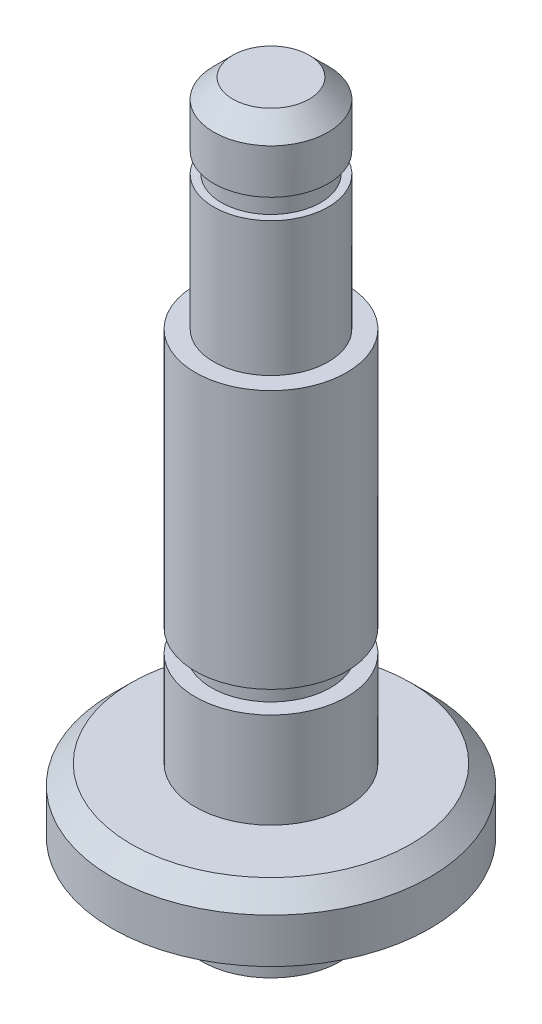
ISO-10303-21;
HEADER;
FILE_DESCRIPTION(('STEP AP214'),'2;1');
FILE_NAME('part.step','',(''),(''),'','','');
FILE_SCHEMA(('AUTOMOTIVE_DESIGN { 1 0 10303 214 1 1 1 1 }'));
ENDSEC;
DATA;
#1=APPLICATION_CONTEXT('core data for automotive mechanical design processes');
#2=APPLICATION_PROTOCOL_DEFINITION('international standard','automotive_design',2000,#1);
#3=PRODUCT_CONTEXT('',#1,'mechanical');
#4=PRODUCT('Part','Part','',(#3));
#5=PRODUCT_RELATED_PRODUCT_CATEGORY('part','',(#4));
#6=PRODUCT_DEFINITION_FORMATION('','',#4);
#7=PRODUCT_DEFINITION_CONTEXT('part definition',#1,'design');
#8=PRODUCT_DEFINITION('design','',#6,#7);
#9=PRODUCT_DEFINITION_SHAPE('','',#8);
#10=(LENGTH_UNIT() NAMED_UNIT(*) SI_UNIT(.MILLI.,.METRE.));
#11=(NAMED_UNIT(*) PLANE_ANGLE_UNIT() SI_UNIT($,.RADIAN.));
#12=(NAMED_UNIT(*) SI_UNIT($,.STERADIAN.) SOLID_ANGLE_UNIT());
#13=UNCERTAINTY_MEASURE_WITH_UNIT(LENGTH_MEASURE(1.E-05),#10,'distance_accuracy_value','');
#14=(GEOMETRIC_REPRESENTATION_CONTEXT(3) GLOBAL_UNCERTAINTY_ASSIGNED_CONTEXT((#13)) GLOBAL_UNIT_ASSIGNED_CONTEXT((#10,
#11,#12)) REPRESENTATION_CONTEXT('',''));
#15=CARTESIAN_POINT('',(0.,0.,0.));
#16=DIRECTION('',(0.,0.,1.));
#17=DIRECTION('',(1.,0.,0.));
#18=AXIS2_PLACEMENT_3D('',#15,#16,#17);
#19=CARTESIAN_POINT('',(0.,0.,0.));
#20=DIRECTION('',(0.,-1.,0.));
#21=DIRECTION('',(0.,0.,-1.));
#22=AXIS2_PLACEMENT_3D('',#19,#20,#21);
#23=CYLINDRICAL_SURFACE('',#22,2.286);
#24=CARTESIAN_POINT('',(0.,22.9362,0.));
#25=DIRECTION('',(0.,-1.,0.));
#26=DIRECTION('',(0.,0.,-1.));
#27=AXIS2_PLACEMENT_3D('',#24,#25,#26);
#28=CIRCLE('',#27,2.286);
#29=CARTESIAN_POINT('',(0.,22.9362,-2.286));
#30=VERTEX_POINT('',#29);
#31=EDGE_CURVE('E81',#30,#30,#28,.T.);
#32=ORIENTED_EDGE('',*,*,#31,.T.);
#33=EDGE_LOOP('',(#32));
#34=FACE_BOUND('',#33,.T.);
#35=CARTESIAN_POINT('',(0.,17.5768,0.));
#36=DIRECTION('',(0.,-1.,0.));
#37=DIRECTION('',(0.,0.,-1.));
#38=AXIS2_PLACEMENT_3D('',#35,#36,#37);
#39=CIRCLE('',#38,2.286);
#40=CARTESIAN_POINT('',(0.,17.5768,-2.286));
#41=VERTEX_POINT('',#40);
#42=EDGE_CURVE('E63',#41,#41,#39,.T.);
#43=ORIENTED_EDGE('',*,*,#42,.F.);
#44=EDGE_LOOP('',(#43));
#45=FACE_BOUND('',#44,.T.);
#46=ADVANCED_FACE('F31',(#34,#45),#23,.T.);
#47=CARTESIAN_POINT('',(0.,0.,0.));
#48=DIRECTION('',(0.,-1.,0.));
#49=DIRECTION('',(0.,0.,-1.));
#50=AXIS2_PLACEMENT_3D('',#47,#48,#49);
#51=CYLINDRICAL_SURFACE('',#50,3.0226);
#52=CARTESIAN_POINT('',(0.,6.35,0.));
#53=DIRECTION('',(0.,-1.,0.));
#54=DIRECTION('',(0.,0.,-1.));
#55=AXIS2_PLACEMENT_3D('',#52,#53,#54);
#56=CIRCLE('',#55,3.0226);
#57=CARTESIAN_POINT('',(0.,6.35,-3.0226));
#58=VERTEX_POINT('',#57);
#59=EDGE_CURVE('E69',#58,#58,#56,.T.);
#60=ORIENTED_EDGE('',*,*,#59,.T.);
#61=EDGE_LOOP('',(#60));
#62=FACE_BOUND('',#61,.T.);
#63=CARTESIAN_POINT('',(0.,2.54,0.));
#64=DIRECTION('',(0.,-1.,0.));
#65=DIRECTION('',(0.,0.,-1.));
#66=AXIS2_PLACEMENT_3D('',#63,#64,#65);
#67=CIRCLE('',#66,3.0226);
#68=CARTESIAN_POINT('',(0.,2.54,-3.0226));
#69=VERTEX_POINT('',#68);
#70=EDGE_CURVE('E57',#69,#69,#67,.T.);
#71=ORIENTED_EDGE('',*,*,#70,.F.);
#72=EDGE_LOOP('',(#71));
#73=FACE_BOUND('',#72,.T.);
#74=ADVANCED_FACE('F107',(#62,#73),#51,.T.);
#75=CARTESIAN_POINT('',(0.,0.,0.));
#76=DIRECTION('',(0.,-1.,0.));
#77=DIRECTION('',(0.,0.,-1.));
#78=AXIS2_PLACEMENT_3D('',#75,#76,#77);
#79=CYLINDRICAL_SURFACE('',#78,2.778125);
#80=CARTESIAN_POINT('',(0.,0.,0.));
#81=DIRECTION('',(0.,-1.,0.));
#82=DIRECTION('',(0.,0.,-1.));
#83=AXIS2_PLACEMENT_3D('',#80,#81,#82);
#84=CIRCLE('',#83,2.778125);
#85=CARTESIAN_POINT('',(0.,0.,-2.778125));
#86=VERTEX_POINT('',#85);
#87=EDGE_CURVE('E51',#86,#86,#84,.T.);
#88=ORIENTED_EDGE('',*,*,#87,.T.);
#89=EDGE_LOOP('',(#88));
#90=FACE_BOUND('',#89,.T.);
#91=CARTESIAN_POINT('',(0.,-2.921,0.));
#92=DIRECTION('',(0.,-1.,0.));
#93=DIRECTION('',(0.,0.,-1.));
#94=AXIS2_PLACEMENT_3D('',#91,#92,#93);
#95=CIRCLE('',#94,2.778125);
#96=CARTESIAN_POINT('',(0.,-2.921,-2.778125));
#97=VERTEX_POINT('',#96);
#98=EDGE_CURVE('E66',#97,#97,#95,.T.);
#99=ORIENTED_EDGE('',*,*,#98,.F.);
#100=EDGE_LOOP('',(#99));
#101=FACE_BOUND('',#100,.T.);
#102=ADVANCED_FACE('F112',(#90,#101),#79,.T.);
#103=CARTESIAN_POINT('',(0.,0.,-2.778125));
#104=DIRECTION('',(0.,-1.,0.));
#105=DIRECTION('',(0.,0.,-1.));
#106=AXIS2_PLACEMENT_3D('',#103,#104,#105);
#107=PLANE('',#106);
#108=CARTESIAN_POINT('',(0.,0.,0.));
#109=DIRECTION('',(0.,-1.,0.));
#110=DIRECTION('',(0.,0.,-1.));
#111=AXIS2_PLACEMENT_3D('',#108,#109,#110);
#112=CIRCLE('',#111,6.35);
#113=CARTESIAN_POINT('',(0.,0.,-6.35));
#114=VERTEX_POINT('',#113);
#115=EDGE_CURVE('E54',#114,#114,#112,.T.);
#116=ORIENTED_EDGE('',*,*,#115,.T.);
#117=EDGE_LOOP('',(#116));
#118=FACE_BOUND('',#117,.T.);
#119=ORIENTED_EDGE('',*,*,#87,.F.);
#120=EDGE_LOOP('',(#119));
#121=FACE_BOUND('',#120,.T.);
#122=ADVANCED_FACE('F145',(#118,#121),#107,.T.);
#123=CARTESIAN_POINT('',(0.,0.,0.));
#124=DIRECTION('',(0.,-1.,0.));
#125=DIRECTION('',(0.,0.,-1.));
#126=AXIS2_PLACEMENT_3D('',#123,#124,#125);
#127=CYLINDRICAL_SURFACE('',#126,6.35);
#128=CARTESIAN_POINT('',(0.,1.778,0.));
#129=DIRECTION('',(0.,1.,0.));
#130=DIRECTION('',(0.,0.,1.));
#131=AXIS2_PLACEMENT_3D('',#128,#129,#130);
#132=CIRCLE('',#131,6.35);
#133=CARTESIAN_POINT('',(0.,1.778,6.35));
#134=VERTEX_POINT('',#133);
#135=EDGE_CURVE('E46',#134,#134,#132,.F.);
#136=ORIENTED_EDGE('',*,*,#135,.T.);
#137=EDGE_LOOP('',(#136));
#138=FACE_BOUND('',#137,.T.);
#139=ORIENTED_EDGE('',*,*,#115,.F.);
#140=EDGE_LOOP('',(#139));
#141=FACE_BOUND('',#140,.T.);
#142=ADVANCED_FACE('F141',(#138,#141),#127,.T.);
#143=CARTESIAN_POINT('',(0.,2.54,-6.35));
#144=DIRECTION('',(0.,1.,0.));
#145=DIRECTION('',(0.,0.,1.));
#146=AXIS2_PLACEMENT_3D('',#143,#144,#145);
#147=PLANE('',#146);
#148=CARTESIAN_POINT('',(0.,2.54,0.));
#149=DIRECTION('',(0.,1.,0.));
#150=DIRECTION('',(0.,0.,1.));
#151=AXIS2_PLACEMENT_3D('',#148,#149,#150);
#152=CIRCLE('',#151,5.588);
#153=CARTESIAN_POINT('',(0.,2.54,5.588));
#154=VERTEX_POINT('',#153);
#155=EDGE_CURVE('E42',#154,#154,#152,.T.);
#156=ORIENTED_EDGE('',*,*,#155,.T.);
#157=EDGE_LOOP('',(#156));
#158=FACE_BOUND('',#157,.T.);
#159=ORIENTED_EDGE('',*,*,#70,.T.);
#160=EDGE_LOOP('',(#159));
#161=FACE_BOUND('',#160,.T.);
#162=ADVANCED_FACE('F137',(#158,#161),#147,.T.);
#163=CARTESIAN_POINT('',(0.,-2.921,0.));
#164=DIRECTION('',(0.,-1.,0.));
#165=DIRECTION('',(0.,0.,-1.));
#166=AXIS2_PLACEMENT_3D('',#163,#164,#165);
#167=PLANE('',#166);
#168=ORIENTED_EDGE('',*,*,#98,.T.);
#169=EDGE_LOOP('',(#168));
#170=FACE_BOUND('',#169,.T.);
#171=ADVANCED_FACE('F140',(#170),#167,.T.);
#172=CARTESIAN_POINT('',(0.,1.778,0.));
#173=DIRECTION('',(0.,-1.,0.));
#174=DIRECTION('',(0.,0.,-1.));
#175=AXIS2_PLACEMENT_3D('',#172,#173,#174);
#176=CONICAL_SURFACE('',#175,6.35,0.78539816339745);
#177=ORIENTED_EDGE('',*,*,#155,.F.);
#178=EDGE_LOOP('',(#177));
#179=FACE_BOUND('',#178,.T.);
#180=ORIENTED_EDGE('',*,*,#135,.F.);
#181=EDGE_LOOP('',(#180));
#182=FACE_BOUND('',#181,.T.);
#183=ADVANCED_FACE('F152',(#179,#182),#176,.T.);
#184=CARTESIAN_POINT('',(0.,6.35,-3.0226));
#185=DIRECTION('',(0.,-1.,0.));
#186=DIRECTION('',(0.,0.,-1.));
#187=AXIS2_PLACEMENT_3D('',#184,#185,#186);
#188=PLANE('',#187);
#189=ORIENTED_EDGE('',*,*,#59,.F.);
#190=EDGE_LOOP('',(#189));
#191=FACE_BOUND('',#190,.T.);
#192=CARTESIAN_POINT('',(0.,6.35,0.));
#193=DIRECTION('',(0.,-1.,0.));
#194=DIRECTION('',(0.,0.,-1.));
#195=AXIS2_PLACEMENT_3D('',#192,#193,#194);
#196=CIRCLE('',#195,2.38125);
#197=CARTESIAN_POINT('',(0.,6.35,-2.38125));
#198=VERTEX_POINT('',#197);
#199=EDGE_CURVE('E72',#198,#198,#196,.T.);
#200=ORIENTED_EDGE('',*,*,#199,.T.);
#201=EDGE_LOOP('',(#200));
#202=FACE_BOUND('',#201,.T.);
#203=ADVANCED_FACE('F154',(#191,#202),#188,.F.);
#204=CARTESIAN_POINT('',(0.,0.,0.));
#205=DIRECTION('',(0.,-1.,0.));
#206=DIRECTION('',(0.,0.,-1.));
#207=AXIS2_PLACEMENT_3D('',#204,#205,#206);
#208=CYLINDRICAL_SURFACE('',#207,2.38125);
#209=ORIENTED_EDGE('',*,*,#199,.F.);
#210=EDGE_LOOP('',(#209));
#211=FACE_BOUND('',#210,.T.);
#212=CARTESIAN_POINT('',(0.,7.239,0.));
#213=DIRECTION('',(0.,-1.,0.));
#214=DIRECTION('',(0.,0.,-1.));
#215=AXIS2_PLACEMENT_3D('',#212,#213,#214);
#216=CIRCLE('',#215,2.38125);
#217=CARTESIAN_POINT('',(0.,7.239,-2.38125));
#218=VERTEX_POINT('',#217);
#219=EDGE_CURVE('E75',#218,#218,#216,.T.);
#220=ORIENTED_EDGE('',*,*,#219,.T.);
#221=EDGE_LOOP('',(#220));
#222=FACE_BOUND('',#221,.T.);
#223=ADVANCED_FACE('F160',(#211,#222),#208,.T.);
#224=CARTESIAN_POINT('',(0.,7.239,-3.0226));
#225=DIRECTION('',(0.,1.,0.));
#226=DIRECTION('',(0.,0.,1.));
#227=AXIS2_PLACEMENT_3D('',#224,#225,#226);
#228=PLANE('',#227);
#229=ORIENTED_EDGE('',*,*,#219,.F.);
#230=EDGE_LOOP('',(#229));
#231=FACE_BOUND('',#230,.T.);
#232=CARTESIAN_POINT('',(0.,7.239,0.));
#233=DIRECTION('',(0.,-1.,0.));
#234=DIRECTION('',(0.,0.,-1.));
#235=AXIS2_PLACEMENT_3D('',#232,#233,#234);
#236=CIRCLE('',#235,3.0226);
#237=CARTESIAN_POINT('',(0.,7.239,-3.0226));
#238=VERTEX_POINT('',#237);
#239=EDGE_CURVE('E78',#238,#238,#236,.T.);
#240=ORIENTED_EDGE('',*,*,#239,.T.);
#241=EDGE_LOOP('',(#240));
#242=FACE_BOUND('',#241,.T.);
#243=ADVANCED_FACE('F123',(#231,#242),#228,.F.);
#244=CARTESIAN_POINT('',(0.,17.5768,-3.0226));
#245=DIRECTION('',(0.,1.,0.));
#246=DIRECTION('',(0.,0.,1.));
#247=AXIS2_PLACEMENT_3D('',#244,#245,#246);
#248=PLANE('',#247);
#249=ORIENTED_EDGE('',*,*,#42,.T.);
#250=EDGE_LOOP('',(#249));
#251=FACE_BOUND('',#250,.T.);
#252=CARTESIAN_POINT('',(0.,17.5768,0.));
#253=DIRECTION('',(0.,-1.,0.));
#254=DIRECTION('',(0.,0.,-1.));
#255=AXIS2_PLACEMENT_3D('',#252,#253,#254);
#256=CIRCLE('',#255,3.0226);
#257=CARTESIAN_POINT('',(0.,17.5768,-3.0226));
#258=VERTEX_POINT('',#257);
#259=EDGE_CURVE('E60',#258,#258,#256,.T.);
#260=ORIENTED_EDGE('',*,*,#259,.F.);
#261=EDGE_LOOP('',(#260));
#262=FACE_BOUND('',#261,.T.);
#263=ADVANCED_FACE('F120',(#251,#262),#248,.T.);
#264=ORIENTED_EDGE('',*,*,#239,.F.);
#265=EDGE_LOOP('',(#264));
#266=FACE_BOUND('',#265,.T.);
#267=ORIENTED_EDGE('',*,*,#259,.T.);
#268=EDGE_LOOP('',(#267));
#269=FACE_BOUND('',#268,.T.);
#270=ADVANCED_FACE('F115',(#266,#269),#51,.T.);
#271=CARTESIAN_POINT('',(0.,22.9362,-2.286));
#272=DIRECTION('',(0.,-1.,0.));
#273=DIRECTION('',(0.,0.,-1.));
#274=AXIS2_PLACEMENT_3D('',#271,#272,#273);
#275=PLANE('',#274);
#276=ORIENTED_EDGE('',*,*,#31,.F.);
#277=EDGE_LOOP('',(#276));
#278=FACE_BOUND('',#277,.T.);
#279=CARTESIAN_POINT('',(0.,22.9362,0.));
#280=DIRECTION('',(0.,-1.,0.));
#281=DIRECTION('',(0.,0.,-1.));
#282=AXIS2_PLACEMENT_3D('',#279,#280,#281);
#283=CIRCLE('',#282,1.9812);
#284=CARTESIAN_POINT('',(0.,22.9362,-1.9812));
#285=VERTEX_POINT('',#284);
#286=EDGE_CURVE('E84',#285,#285,#283,.T.);
#287=ORIENTED_EDGE('',*,*,#286,.T.);
#288=EDGE_LOOP('',(#287));
#289=FACE_BOUND('',#288,.T.);
#290=ADVANCED_FACE('F127',(#278,#289),#275,.F.);
#291=CARTESIAN_POINT('',(0.,0.,0.));
#292=DIRECTION('',(0.,-1.,0.));
#293=DIRECTION('',(0.,0.,-1.));
#294=AXIS2_PLACEMENT_3D('',#291,#292,#293);
#295=CYLINDRICAL_SURFACE('',#294,1.9812);
#296=ORIENTED_EDGE('',*,*,#286,.F.);
#297=EDGE_LOOP('',(#296));
#298=FACE_BOUND('',#297,.T.);
#299=CARTESIAN_POINT('',(0.,23.7460698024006,0.));
#300=DIRECTION('',(0.,-1.,0.));
#301=DIRECTION('',(0.,0.,-1.));
#302=AXIS2_PLACEMENT_3D('',#299,#300,#301);
#303=CIRCLE('',#302,1.9812);
#304=CARTESIAN_POINT('',(0.,23.7460698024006,-1.9812));
#305=VERTEX_POINT('',#304);
#306=EDGE_CURVE('E87',#305,#305,#303,.T.);
#307=ORIENTED_EDGE('',*,*,#306,.T.);
#308=EDGE_LOOP('',(#307));
#309=FACE_BOUND('',#308,.T.);
#310=ADVANCED_FACE('F132',(#298,#309),#295,.T.);
#311=CARTESIAN_POINT('',(0.,23.7460698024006,-2.286));
#312=DIRECTION('',(0.,1.,0.));
#313=DIRECTION('',(0.,0.,1.));
#314=AXIS2_PLACEMENT_3D('',#311,#312,#313);
#315=PLANE('',#314);
#316=ORIENTED_EDGE('',*,*,#306,.F.);
#317=EDGE_LOOP('',(#316));
#318=FACE_BOUND('',#317,.T.);
#319=CARTESIAN_POINT('',(0.,23.7460698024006,0.));
#320=DIRECTION('',(0.,-1.,0.));
#321=DIRECTION('',(0.,0.,-1.));
#322=AXIS2_PLACEMENT_3D('',#319,#320,#321);
#323=CIRCLE('',#322,2.286);
#324=CARTESIAN_POINT('',(0.,23.7460698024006,-2.286));
#325=VERTEX_POINT('',#324);
#326=EDGE_CURVE('E90',#325,#325,#323,.T.);
#327=ORIENTED_EDGE('',*,*,#326,.T.);
#328=EDGE_LOOP('',(#327));
#329=FACE_BOUND('',#328,.T.);
#330=ADVANCED_FACE('F94',(#318,#329),#315,.F.);
#331=CARTESIAN_POINT('',(0.,26.289,-2.286));
#332=DIRECTION('',(0.,1.,0.));
#333=DIRECTION('',(0.,0.,1.));
#334=AXIS2_PLACEMENT_3D('',#331,#332,#333);
#335=PLANE('',#334);
#336=CARTESIAN_POINT('',(0.,26.289,0.));
#337=DIRECTION('',(0.,1.,0.));
#338=DIRECTION('',(0.,0.,1.));
#339=AXIS2_PLACEMENT_3D('',#336,#337,#338);
#340=CIRCLE('',#339,1.524);
#341=CARTESIAN_POINT('',(0.,26.289,1.524));
#342=VERTEX_POINT('',#341);
#343=EDGE_CURVE('E10',#342,#342,#340,.T.);
#344=ORIENTED_EDGE('',*,*,#343,.T.);
#345=EDGE_LOOP('',(#344));
#346=FACE_BOUND('',#345,.T.);
#347=ADVANCED_FACE('F102',(#346),#335,.T.);
#348=CARTESIAN_POINT('',(0.,25.527,0.));
#349=DIRECTION('',(0.,-1.,0.));
#350=DIRECTION('',(0.,0.,-1.));
#351=AXIS2_PLACEMENT_3D('',#348,#349,#350);
#352=CONICAL_SURFACE('',#351,2.286,0.785398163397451);
#353=ORIENTED_EDGE('',*,*,#343,.F.);
#354=EDGE_LOOP('',(#353));
#355=FACE_BOUND('',#354,.T.);
#356=CARTESIAN_POINT('',(0.,25.527,0.));
#357=DIRECTION('',(0.,1.,0.));
#358=DIRECTION('',(0.,0.,1.));
#359=AXIS2_PLACEMENT_3D('',#356,#357,#358);
#360=CIRCLE('',#359,2.286);
#361=CARTESIAN_POINT('',(0.,25.527,2.286));
#362=VERTEX_POINT('',#361);
#363=EDGE_CURVE('E38',#362,#362,#360,.F.);
#364=ORIENTED_EDGE('',*,*,#363,.F.);
#365=EDGE_LOOP('',(#364));
#366=FACE_BOUND('',#365,.T.);
#367=ADVANCED_FACE('F33',(#355,#366),#352,.T.);
#368=ORIENTED_EDGE('',*,*,#326,.F.);
#369=EDGE_LOOP('',(#368));
#370=FACE_BOUND('',#369,.T.);
#371=ORIENTED_EDGE('',*,*,#363,.T.);
#372=EDGE_LOOP('',(#371));
#373=FACE_BOUND('',#372,.T.);
#374=ADVANCED_FACE('F96',(#370,#373),#23,.T.);
#375=CLOSED_SHELL('',(#46,#74,#102,#122,#142,#162,#171,#183,#203,#223,#243,#263,#270,#290,#310,
#330,#347,#367,#374));
#376=MANIFOLD_SOLID_BREP('B2',#375);
#377=ADVANCED_BREP_SHAPE_REPRESENTATION('',(#18,#376),#14);
#378=SHAPE_DEFINITION_REPRESENTATION(#9,#377);
ENDSEC;
END-ISO-10303-21;
